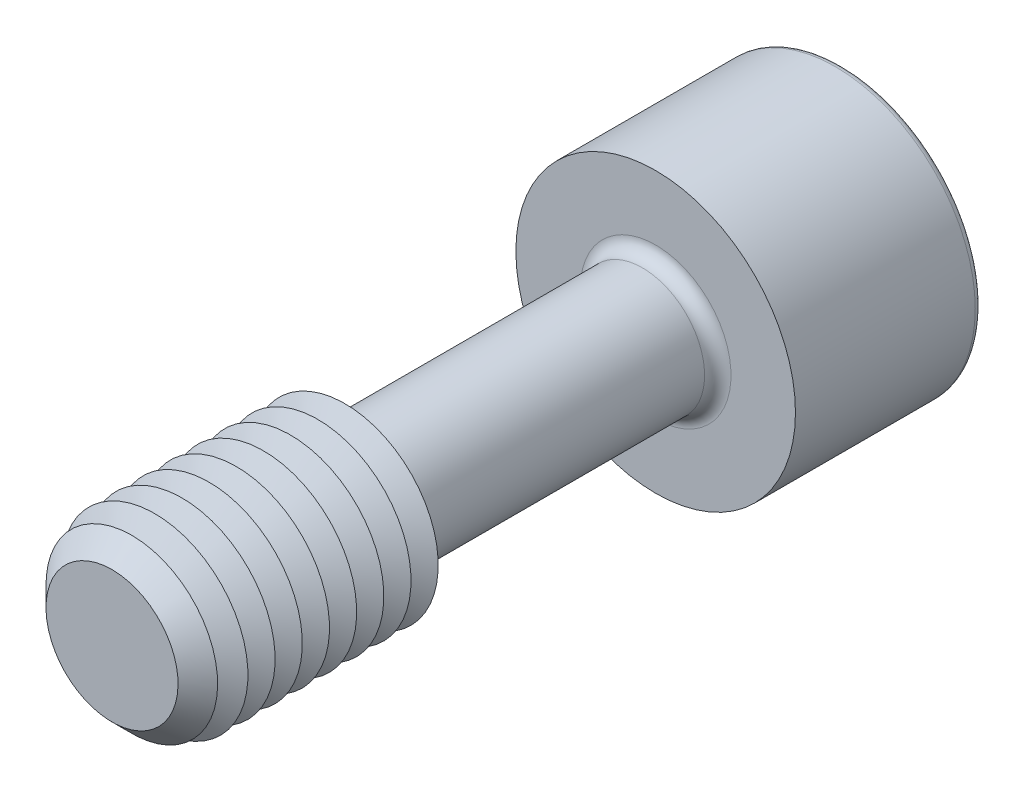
ISO-10303-21;
HEADER;
FILE_DESCRIPTION(('STEP AP214'),'2;1');
FILE_NAME('part.step','',(''),(''),'','','');
FILE_SCHEMA(('AUTOMOTIVE_DESIGN { 1 0 10303 214 1 1 1 1 }'));
ENDSEC;
DATA;
#1=APPLICATION_CONTEXT('core data for automotive mechanical design processes');
#2=APPLICATION_PROTOCOL_DEFINITION('international standard','automotive_design',2000,#1);
#3=PRODUCT_CONTEXT('',#1,'mechanical');
#4=PRODUCT('Part','Part','',(#3));
#5=PRODUCT_RELATED_PRODUCT_CATEGORY('part','',(#4));
#6=PRODUCT_DEFINITION_FORMATION('','',#4);
#7=PRODUCT_DEFINITION_CONTEXT('part definition',#1,'design');
#8=PRODUCT_DEFINITION('design','',#6,#7);
#9=PRODUCT_DEFINITION_SHAPE('','',#8);
#10=(LENGTH_UNIT() NAMED_UNIT(*) SI_UNIT(.MILLI.,.METRE.));
#11=(NAMED_UNIT(*) PLANE_ANGLE_UNIT() SI_UNIT($,.RADIAN.));
#12=(NAMED_UNIT(*) SI_UNIT($,.STERADIAN.) SOLID_ANGLE_UNIT());
#13=UNCERTAINTY_MEASURE_WITH_UNIT(LENGTH_MEASURE(1.E-05),#10,'distance_accuracy_value','');
#14=(GEOMETRIC_REPRESENTATION_CONTEXT(3) GLOBAL_UNCERTAINTY_ASSIGNED_CONTEXT((#13)) GLOBAL_UNIT_ASSIGNED_CONTEXT((#10,
#11,#12)) REPRESENTATION_CONTEXT('',''));
#15=CARTESIAN_POINT('',(0.,0.,0.));
#16=DIRECTION('',(0.,0.,1.));
#17=DIRECTION('',(1.,0.,0.));
#18=AXIS2_PLACEMENT_3D('',#15,#16,#17);
#19=CARTESIAN_POINT('',(-2.88675134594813,-5.,-19.5));
#20=DIRECTION('',(0.,0.,1.));
#21=DIRECTION('',(1.,0.,0.));
#22=AXIS2_PLACEMENT_3D('',#19,#20,#21);
#23=PLANE('',#22);
#24=DIRECTION('',(1.,0.,0.));
#25=VECTOR('',#24,1.);
#26=CARTESIAN_POINT('',(-2.88675134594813,-5.,-19.5));
#27=LINE('',#26,#25);
#28=CARTESIAN_POINT('',(0.,-5.,-19.5));
#29=VERTEX_POINT('',#28);
#30=CARTESIAN_POINT('',(2.88675134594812,-5.,-19.5));
#31=VERTEX_POINT('',#30);
#32=EDGE_CURVE('E762',#29,#31,#27,.T.);
#33=ORIENTED_EDGE('',*,*,#32,.F.);
#34=CARTESIAN_POINT('',(0.,0.,-19.5));
#35=DIRECTION('',(0.,0.,1.));
#36=DIRECTION('',(0.,-1.,0.));
#37=AXIS2_PLACEMENT_3D('',#34,#35,#36);
#38=CIRCLE('',#37,5.);
#39=CARTESIAN_POINT('',(4.3301270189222,-2.5,-19.5));
#40=VERTEX_POINT('',#39);
#41=EDGE_CURVE('E53',#29,#40,#38,.T.);
#42=ORIENTED_EDGE('',*,*,#41,.T.);
#43=DIRECTION('',(0.5,0.866025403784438,0.));
#44=VECTOR('',#43,1.);
#45=CARTESIAN_POINT('',(2.88675134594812,-5.,-19.5));
#46=LINE('',#45,#44);
#47=EDGE_CURVE('E747',#31,#40,#46,.T.);
#48=ORIENTED_EDGE('',*,*,#47,.F.);
#49=EDGE_LOOP('',(#33,#42,#48));
#50=FACE_BOUND('',#49,.T.);
#51=ADVANCED_FACE('F41',(#50),#23,.F.);
#52=CARTESIAN_POINT('',(5.77350269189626,0.,-19.5));
#53=VERTEX_POINT('',#52);
#54=EDGE_CURVE('E758',#40,#53,#46,.T.);
#55=ORIENTED_EDGE('',*,*,#54,.F.);
#56=CARTESIAN_POINT('',(4.3301270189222,2.50000000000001,-19.5));
#57=VERTEX_POINT('',#56);
#58=EDGE_CURVE('E11',#40,#57,#38,.T.);
#59=ORIENTED_EDGE('',*,*,#58,.T.);
#60=DIRECTION('',(-0.5,0.866025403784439,0.));
#61=VECTOR('',#60,1.);
#62=CARTESIAN_POINT('',(5.77350269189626,0.,-19.5));
#63=LINE('',#62,#61);
#64=EDGE_CURVE('E746',#53,#57,#63,.T.);
#65=ORIENTED_EDGE('',*,*,#64,.F.);
#66=EDGE_LOOP('',(#55,#59,#65));
#67=FACE_BOUND('',#66,.T.);
#68=ADVANCED_FACE('F133',(#67),#23,.F.);
#69=CARTESIAN_POINT('',(2.88675134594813,5.,-19.5));
#70=VERTEX_POINT('',#69);
#71=EDGE_CURVE('E741',#57,#70,#63,.T.);
#72=ORIENTED_EDGE('',*,*,#71,.F.);
#73=CARTESIAN_POINT('',(0.,5.00000000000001,-19.5));
#74=VERTEX_POINT('',#73);
#75=EDGE_CURVE('E51',#57,#74,#38,.T.);
#76=ORIENTED_EDGE('',*,*,#75,.T.);
#77=DIRECTION('',(-1.,0.,0.));
#78=VECTOR('',#77,1.);
#79=CARTESIAN_POINT('',(2.88675134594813,5.,-19.5));
#80=LINE('',#79,#78);
#81=EDGE_CURVE('E177',#70,#74,#80,.T.);
#82=ORIENTED_EDGE('',*,*,#81,.F.);
#83=EDGE_LOOP('',(#72,#76,#82));
#84=FACE_BOUND('',#83,.T.);
#85=ADVANCED_FACE('F139',(#84),#23,.F.);
#86=CARTESIAN_POINT('',(-2.88675134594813,5.,-19.5));
#87=VERTEX_POINT('',#86);
#88=EDGE_CURVE('E752',#74,#87,#80,.T.);
#89=ORIENTED_EDGE('',*,*,#88,.F.);
#90=CARTESIAN_POINT('',(-4.3301270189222,2.50000000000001,-19.5));
#91=VERTEX_POINT('',#90);
#92=EDGE_CURVE('E265',#74,#91,#38,.T.);
#93=ORIENTED_EDGE('',*,*,#92,.T.);
#94=DIRECTION('',(-0.5,-0.866025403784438,0.));
#95=VECTOR('',#94,1.);
#96=CARTESIAN_POINT('',(-2.88675134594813,5.,-19.5));
#97=LINE('',#96,#95);
#98=EDGE_CURVE('E176',#87,#91,#97,.T.);
#99=ORIENTED_EDGE('',*,*,#98,.F.);
#100=EDGE_LOOP('',(#89,#93,#99));
#101=FACE_BOUND('',#100,.T.);
#102=ADVANCED_FACE('F157',(#101),#23,.F.);
#103=CARTESIAN_POINT('',(-5.77350269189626,0.,-19.5));
#104=VERTEX_POINT('',#103);
#105=EDGE_CURVE('E170',#91,#104,#97,.T.);
#106=ORIENTED_EDGE('',*,*,#105,.F.);
#107=CARTESIAN_POINT('',(-4.3301270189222,-2.5,-19.5));
#108=VERTEX_POINT('',#107);
#109=EDGE_CURVE('E172',#91,#108,#38,.T.);
#110=ORIENTED_EDGE('',*,*,#109,.T.);
#111=DIRECTION('',(0.5,-0.866025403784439,0.));
#112=VECTOR('',#111,1.);
#113=CARTESIAN_POINT('',(-5.77350269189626,0.,-19.5));
#114=LINE('',#113,#112);
#115=EDGE_CURVE('E174',#104,#108,#114,.T.);
#116=ORIENTED_EDGE('',*,*,#115,.F.);
#117=EDGE_LOOP('',(#106,#110,#116));
#118=FACE_BOUND('',#117,.T.);
#119=ADVANCED_FACE('F146',(#118),#23,.F.);
#120=CARTESIAN_POINT('',(0.,0.,-29.5));
#121=DIRECTION('',(0.,0.,-1.));
#122=DIRECTION('',(-1.,0.,0.));
#123=AXIS2_PLACEMENT_3D('',#120,#121,#122);
#124=PLANE('',#123);
#125=CARTESIAN_POINT('',(0.,0.,-29.5));
#126=DIRECTION('',(0.,0.,-1.));
#127=DIRECTION('',(-1.,0.,0.));
#128=AXIS2_PLACEMENT_3D('',#125,#126,#127);
#129=CIRCLE('',#128,8.575);
#130=CARTESIAN_POINT('',(-8.575,0.,-29.5));
#131=VERTEX_POINT('',#130);
#132=EDGE_CURVE('E250',#131,#131,#129,.T.);
#133=ORIENTED_EDGE('',*,*,#132,.T.);
#134=EDGE_LOOP('',(#133));
#135=FACE_BOUND('',#134,.T.);
#136=DIRECTION('',(-0.5,-0.866025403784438,0.));
#137=VECTOR('',#136,1.);
#138=CARTESIAN_POINT('',(-2.88675134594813,5.,-29.5));
#139=LINE('',#138,#137);
#140=CARTESIAN_POINT('',(-2.88675134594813,5.,-29.5));
#141=VERTEX_POINT('',#140);
#142=CARTESIAN_POINT('',(-5.77350269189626,0.,-29.5));
#143=VERTEX_POINT('',#142);
#144=EDGE_CURVE('E212',#141,#143,#139,.T.);
#145=ORIENTED_EDGE('',*,*,#144,.T.);
#146=DIRECTION('',(0.5,-0.866025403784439,0.));
#147=VECTOR('',#146,1.);
#148=CARTESIAN_POINT('',(-5.77350269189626,0.,-29.5));
#149=LINE('',#148,#147);
#150=CARTESIAN_POINT('',(-2.88675134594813,-5.,-29.5));
#151=VERTEX_POINT('',#150);
#152=EDGE_CURVE('E67',#143,#151,#149,.T.);
#153=ORIENTED_EDGE('',*,*,#152,.T.);
#154=DIRECTION('',(1.,0.,0.));
#155=VECTOR('',#154,1.);
#156=CARTESIAN_POINT('',(-2.88675134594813,-5.,-29.5));
#157=LINE('',#156,#155);
#158=CARTESIAN_POINT('',(2.88675134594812,-5.,-29.5));
#159=VERTEX_POINT('',#158);
#160=EDGE_CURVE('E196',#151,#159,#157,.T.);
#161=ORIENTED_EDGE('',*,*,#160,.T.);
#162=DIRECTION('',(0.5,0.866025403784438,0.));
#163=VECTOR('',#162,1.);
#164=CARTESIAN_POINT('',(2.88675134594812,-5.,-29.5));
#165=LINE('',#164,#163);
#166=CARTESIAN_POINT('',(5.77350269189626,0.,-29.5));
#167=VERTEX_POINT('',#166);
#168=EDGE_CURVE('E200',#159,#167,#165,.T.);
#169=ORIENTED_EDGE('',*,*,#168,.T.);
#170=DIRECTION('',(-0.5,0.866025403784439,0.));
#171=VECTOR('',#170,1.);
#172=CARTESIAN_POINT('',(5.77350269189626,0.,-29.5));
#173=LINE('',#172,#171);
#174=CARTESIAN_POINT('',(2.88675134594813,5.,-29.5));
#175=VERTEX_POINT('',#174);
#176=EDGE_CURVE('E204',#167,#175,#173,.T.);
#177=ORIENTED_EDGE('',*,*,#176,.T.);
#178=DIRECTION('',(-1.,0.,0.));
#179=VECTOR('',#178,1.);
#180=CARTESIAN_POINT('',(2.88675134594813,5.,-29.5));
#181=LINE('',#180,#179);
#182=EDGE_CURVE('E208',#175,#141,#181,.T.);
#183=ORIENTED_EDGE('',*,*,#182,.T.);
#184=EDGE_LOOP('',(#145,#153,#161,#169,#177,#183));
#185=FACE_BOUND('',#184,.T.);
#186=ADVANCED_FACE('F156',(#135,#185),#124,.T.);
#187=CARTESIAN_POINT('',(0.,0.,17.5));
#188=DIRECTION('',(0.,0.,-1.));
#189=DIRECTION('',(-1.,0.,0.));
#190=AXIS2_PLACEMENT_3D('',#187,#188,#189);
#191=CYLINDRICAL_SURFACE('',#190,4.);
#192=CARTESIAN_POINT('',(0.,0.,-16.65));
#193=DIRECTION('',(0.,0.,-1.));
#194=DIRECTION('',(-1.,0.,0.));
#195=AXIS2_PLACEMENT_3D('',#192,#193,#194);
#196=CIRCLE('',#195,4.);
#197=CARTESIAN_POINT('',(-4.,0.,-16.65));
#198=VERTEX_POINT('',#197);
#199=EDGE_CURVE('E246',#198,#198,#196,.F.);
#200=ORIENTED_EDGE('',*,*,#199,.T.);
#201=EDGE_LOOP('',(#200));
#202=FACE_BOUND('',#201,.T.);
#203=CARTESIAN_POINT('',(0.,0.,1.34529946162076));
#204=DIRECTION('',(0.,0.,-1.));
#205=DIRECTION('',(0.,1.,0.));
#206=AXIS2_PLACEMENT_3D('',#203,#204,#205);
#207=CIRCLE('',#206,4.);
#208=CARTESIAN_POINT('',(0.,4.,1.34529946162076));
#209=VERTEX_POINT('',#208);
#210=EDGE_CURVE('E234',#209,#209,#207,.T.);
#211=ORIENTED_EDGE('',*,*,#210,.T.);
#212=EDGE_LOOP('',(#211));
#213=FACE_BOUND('',#212,.T.);
#214=ADVANCED_FACE('F163',(#202,#213),#191,.T.);
#215=CARTESIAN_POINT('',(0.,0.,1.34529946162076));
#216=DIRECTION('',(0.,0.,1.));
#217=DIRECTION('',(0.,-1.,0.));
#218=AXIS2_PLACEMENT_3D('',#215,#216,#217);
#219=CONICAL_SURFACE('',#218,4.,1.0471975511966);
#220=CARTESIAN_POINT('',(0.,0.,2.5));
#221=DIRECTION('',(0.,0.,-1.));
#222=DIRECTION('',(-1.,0.,0.));
#223=AXIS2_PLACEMENT_3D('',#220,#221,#222);
#224=CIRCLE('',#223,6.);
#225=CARTESIAN_POINT('',(-6.,0.,2.5));
#226=VERTEX_POINT('',#225);
#227=EDGE_CURVE('E269',#226,#226,#224,.T.);
#228=ORIENTED_EDGE('',*,*,#227,.T.);
#229=EDGE_LOOP('',(#228));
#230=FACE_BOUND('',#229,.T.);
#231=ORIENTED_EDGE('',*,*,#210,.F.);
#232=EDGE_LOOP('',(#231));
#233=FACE_BOUND('',#232,.T.);
#234=ADVANCED_FACE('F510',(#230,#233),#219,.T.);
#235=CARTESIAN_POINT('',(0.,0.,-17.5));
#236=DIRECTION('',(0.,0.,-1.));
#237=DIRECTION('',(-1.,0.,0.));
#238=AXIS2_PLACEMENT_3D('',#235,#236,#237);
#239=PLANE('',#238);
#240=CARTESIAN_POINT('',(0.,0.,-17.5));
#241=DIRECTION('',(0.,0.,-1.));
#242=DIRECTION('',(-1.,0.,0.));
#243=AXIS2_PLACEMENT_3D('',#240,#241,#242);
#244=CIRCLE('',#243,4.85);
#245=CARTESIAN_POINT('',(-4.85,0.,-17.5));
#246=VERTEX_POINT('',#245);
#247=EDGE_CURVE('E242',#246,#246,#244,.T.);
#248=ORIENTED_EDGE('',*,*,#247,.T.);
#249=EDGE_LOOP('',(#248));
#250=FACE_BOUND('',#249,.T.);
#251=CARTESIAN_POINT('',(0.,0.,-17.5));
#252=DIRECTION('',(0.,0.,-1.));
#253=DIRECTION('',(-1.,0.,0.));
#254=AXIS2_PLACEMENT_3D('',#251,#252,#253);
#255=CIRCLE('',#254,9.);
#256=CARTESIAN_POINT('',(-9.,0.,-17.5));
#257=VERTEX_POINT('',#256);
#258=EDGE_CURVE('E230',#257,#257,#255,.T.);
#259=ORIENTED_EDGE('',*,*,#258,.F.);
#260=EDGE_LOOP('',(#259));
#261=FACE_BOUND('',#260,.T.);
#262=ADVANCED_FACE('F503',(#250,#261),#239,.F.);
#263=CARTESIAN_POINT('',(0.,0.,-29.5));
#264=DIRECTION('',(0.,0.,1.));
#265=DIRECTION('',(1.,0.,0.));
#266=AXIS2_PLACEMENT_3D('',#263,#264,#265);
#267=CYLINDRICAL_SURFACE('',#266,9.);
#268=CARTESIAN_POINT('',(0.,0.,-29.075));
#269=DIRECTION('',(0.,0.,-1.));
#270=DIRECTION('',(-1.,0.,0.));
#271=AXIS2_PLACEMENT_3D('',#268,#269,#270);
#272=CIRCLE('',#271,9.);
#273=CARTESIAN_POINT('',(-9.,0.,-29.075));
#274=VERTEX_POINT('',#273);
#275=EDGE_CURVE('E253',#274,#274,#272,.F.);
#276=ORIENTED_EDGE('',*,*,#275,.T.);
#277=EDGE_LOOP('',(#276));
#278=FACE_BOUND('',#277,.T.);
#279=ORIENTED_EDGE('',*,*,#258,.T.);
#280=EDGE_LOOP('',(#279));
#281=FACE_BOUND('',#280,.T.);
#282=ADVANCED_FACE('F509',(#278,#281),#267,.T.);
#283=CARTESIAN_POINT('',(-5.77350269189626,0.,-19.5));
#284=DIRECTION('',(0.866025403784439,0.5,0.));
#285=DIRECTION('',(-0.5,0.866025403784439,0.));
#286=AXIS2_PLACEMENT_3D('',#283,#284,#285);
#287=PLANE('',#286);
#288=ORIENTED_EDGE('',*,*,#152,.F.);
#289=DIRECTION('',(0.,0.,-1.));
#290=VECTOR('',#289,1.);
#291=CARTESIAN_POINT('',(-5.77350269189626,0.,-19.5));
#292=LINE('',#291,#290);
#293=EDGE_CURVE('E186',#104,#143,#292,.T.);
#294=ORIENTED_EDGE('',*,*,#293,.F.);
#295=ORIENTED_EDGE('',*,*,#115,.T.);
#296=CARTESIAN_POINT('',(-2.88675134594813,-5.,-19.5));
#297=VERTEX_POINT('',#296);
#298=EDGE_CURVE('E215',#108,#297,#114,.T.);
#299=ORIENTED_EDGE('',*,*,#298,.T.);
#300=DIRECTION('',(0.,0.,-1.));
#301=VECTOR('',#300,1.);
#302=CARTESIAN_POINT('',(-2.88675134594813,-5.,-19.5));
#303=LINE('',#302,#301);
#304=EDGE_CURVE('E228',#297,#151,#303,.T.);
#305=ORIENTED_EDGE('',*,*,#304,.T.);
#306=EDGE_LOOP('',(#288,#294,#295,#299,#305));
#307=FACE_BOUND('',#306,.T.);
#308=ADVANCED_FACE('F521',(#307),#287,.T.);
#309=CARTESIAN_POINT('',(-2.88675134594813,-5.,-19.5));
#310=DIRECTION('',(0.,1.,0.));
#311=DIRECTION('',(0.,0.,1.));
#312=AXIS2_PLACEMENT_3D('',#309,#310,#311);
#313=PLANE('',#312);
#314=ORIENTED_EDGE('',*,*,#160,.F.);
#315=ORIENTED_EDGE('',*,*,#304,.F.);
#316=EDGE_CURVE('E759',#297,#29,#27,.T.);
#317=ORIENTED_EDGE('',*,*,#316,.T.);
#318=ORIENTED_EDGE('',*,*,#32,.T.);
#319=DIRECTION('',(0.,0.,-1.));
#320=VECTOR('',#319,1.);
#321=CARTESIAN_POINT('',(2.88675134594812,-5.,-19.5));
#322=LINE('',#321,#320);
#323=EDGE_CURVE('E225',#31,#159,#322,.T.);
#324=ORIENTED_EDGE('',*,*,#323,.T.);
#325=EDGE_LOOP('',(#314,#315,#317,#318,#324));
#326=FACE_BOUND('',#325,.T.);
#327=ADVANCED_FACE('F537',(#326),#313,.T.);
#328=CARTESIAN_POINT('',(2.88675134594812,-5.,-19.5));
#329=DIRECTION('',(-0.866025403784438,0.5,0.));
#330=DIRECTION('',(-0.5,-0.866025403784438,0.));
#331=AXIS2_PLACEMENT_3D('',#328,#329,#330);
#332=PLANE('',#331);
#333=ORIENTED_EDGE('',*,*,#168,.F.);
#334=ORIENTED_EDGE('',*,*,#323,.F.);
#335=ORIENTED_EDGE('',*,*,#47,.T.);
#336=ORIENTED_EDGE('',*,*,#54,.T.);
#337=DIRECTION('',(0.,0.,-1.));
#338=VECTOR('',#337,1.);
#339=CARTESIAN_POINT('',(5.77350269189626,0.,-19.5));
#340=LINE('',#339,#338);
#341=EDGE_CURVE('E222',#53,#167,#340,.T.);
#342=ORIENTED_EDGE('',*,*,#341,.T.);
#343=EDGE_LOOP('',(#333,#334,#335,#336,#342));
#344=FACE_BOUND('',#343,.T.);
#345=ADVANCED_FACE('F547',(#344),#332,.T.);
#346=CARTESIAN_POINT('',(5.77350269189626,0.,-19.5));
#347=DIRECTION('',(-0.866025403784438,-0.5,0.));
#348=DIRECTION('',(0.5,-0.866025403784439,0.));
#349=AXIS2_PLACEMENT_3D('',#346,#347,#348);
#350=PLANE('',#349);
#351=ORIENTED_EDGE('',*,*,#176,.F.);
#352=ORIENTED_EDGE('',*,*,#341,.F.);
#353=ORIENTED_EDGE('',*,*,#64,.T.);
#354=ORIENTED_EDGE('',*,*,#71,.T.);
#355=DIRECTION('',(0.,0.,-1.));
#356=VECTOR('',#355,1.);
#357=CARTESIAN_POINT('',(2.88675134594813,5.,-19.5));
#358=LINE('',#357,#356);
#359=EDGE_CURVE('E219',#70,#175,#358,.T.);
#360=ORIENTED_EDGE('',*,*,#359,.T.);
#361=EDGE_LOOP('',(#351,#352,#353,#354,#360));
#362=FACE_BOUND('',#361,.T.);
#363=ADVANCED_FACE('F557',(#362),#350,.T.);
#364=CARTESIAN_POINT('',(2.88675134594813,5.,-19.5));
#365=DIRECTION('',(0.,-1.,0.));
#366=DIRECTION('',(0.,0.,-1.));
#367=AXIS2_PLACEMENT_3D('',#364,#365,#366);
#368=PLANE('',#367);
#369=ORIENTED_EDGE('',*,*,#182,.F.);
#370=ORIENTED_EDGE('',*,*,#359,.F.);
#371=ORIENTED_EDGE('',*,*,#81,.T.);
#372=ORIENTED_EDGE('',*,*,#88,.T.);
#373=DIRECTION('',(0.,0.,-1.));
#374=VECTOR('',#373,1.);
#375=CARTESIAN_POINT('',(-2.88675134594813,5.,-19.5));
#376=LINE('',#375,#374);
#377=EDGE_CURVE('E182',#87,#141,#376,.T.);
#378=ORIENTED_EDGE('',*,*,#377,.T.);
#379=EDGE_LOOP('',(#369,#370,#371,#372,#378));
#380=FACE_BOUND('',#379,.T.);
#381=ADVANCED_FACE('F152',(#380),#368,.T.);
#382=CARTESIAN_POINT('',(-2.88675134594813,5.,-19.5));
#383=DIRECTION('',(0.866025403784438,-0.5,0.));
#384=DIRECTION('',(0.5,0.866025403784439,0.));
#385=AXIS2_PLACEMENT_3D('',#382,#383,#384);
#386=PLANE('',#385);
#387=ORIENTED_EDGE('',*,*,#144,.F.);
#388=ORIENTED_EDGE('',*,*,#377,.F.);
#389=ORIENTED_EDGE('',*,*,#98,.T.);
#390=ORIENTED_EDGE('',*,*,#105,.T.);
#391=ORIENTED_EDGE('',*,*,#293,.T.);
#392=EDGE_LOOP('',(#387,#388,#389,#390,#391));
#393=FACE_BOUND('',#392,.T.);
#394=ADVANCED_FACE('F144',(#393),#386,.T.);
#395=ORIENTED_EDGE('',*,*,#298,.F.);
#396=EDGE_CURVE('E256',#108,#29,#38,.T.);
#397=ORIENTED_EDGE('',*,*,#396,.T.);
#398=ORIENTED_EDGE('',*,*,#316,.F.);
#399=EDGE_LOOP('',(#395,#397,#398));
#400=FACE_BOUND('',#399,.T.);
#401=ADVANCED_FACE('F135',(#400),#23,.F.);
#402=CARTESIAN_POINT('',(0.,0.,-16.65));
#403=DIRECTION('',(0.,0.,-1.));
#404=DIRECTION('',(-1.,0.,0.));
#405=AXIS2_PLACEMENT_3D('',#402,#403,#404);
#406=TOROIDAL_SURFACE('',#405,4.85,0.85);
#407=ORIENTED_EDGE('',*,*,#199,.F.);
#408=EDGE_LOOP('',(#407));
#409=FACE_BOUND('',#408,.T.);
#410=ORIENTED_EDGE('',*,*,#247,.F.);
#411=EDGE_LOOP('',(#410));
#412=FACE_BOUND('',#411,.T.);
#413=ADVANCED_FACE('F129',(#409,#412),#406,.F.);
#414=CARTESIAN_POINT('',(0.,0.,-29.075));
#415=DIRECTION('',(0.,0.,-1.));
#416=DIRECTION('',(-1.,0.,0.));
#417=AXIS2_PLACEMENT_3D('',#414,#415,#416);
#418=TOROIDAL_SURFACE('',#417,8.575,0.425);
#419=ORIENTED_EDGE('',*,*,#275,.F.);
#420=EDGE_LOOP('',(#419));
#421=FACE_BOUND('',#420,.T.);
#422=ORIENTED_EDGE('',*,*,#132,.F.);
#423=EDGE_LOOP('',(#422));
#424=FACE_BOUND('',#423,.T.);
#425=ADVANCED_FACE('F43',(#421,#424),#418,.T.);
#426=CARTESIAN_POINT('',(0.,0.,-16.6132486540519));
#427=DIRECTION('',(0.,0.,-1.));
#428=DIRECTION('',(0.,1.,0.));
#429=AXIS2_PLACEMENT_3D('',#426,#427,#428);
#430=CONICAL_SURFACE('',#429,0.,1.04719755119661);
#431=ORIENTED_EDGE('',*,*,#41,.F.);
#432=ORIENTED_EDGE('',*,*,#396,.F.);
#433=ORIENTED_EDGE('',*,*,#109,.F.);
#434=ORIENTED_EDGE('',*,*,#92,.F.);
#435=ORIENTED_EDGE('',*,*,#75,.F.);
#436=ORIENTED_EDGE('',*,*,#58,.F.);
#437=EDGE_LOOP('',(#431,#432,#433,#434,#435,#436));
#438=FACE_BOUND('',#437,.T.);
#439=CARTESIAN_POINT('',(0.,0.,-16.6132486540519));
#440=VERTEX_POINT('',#439);
#441=VERTEX_LOOP('',#440);
#442=FACE_BOUND('',#441,.T.);
#443=ADVANCED_FACE('F118',(#438,#442),#430,.F.);
#444=CARTESIAN_POINT('',(0.,0.,3.375));
#445=DIRECTION('',(0.,0.,-1.));
#446=DIRECTION('',(-1.,0.,0.));
#447=AXIS2_PLACEMENT_3D('',#444,#445,#446);
#448=CONICAL_SURFACE('',#447,4.48445554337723,1.0471975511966);
#449=ORIENTED_EDGE('',*,*,#227,.F.);
#450=EDGE_LOOP('',(#449));
#451=FACE_BOUND('',#450,.T.);
#452=CARTESIAN_POINT('',(0.,0.,3.375));
#453=DIRECTION('',(0.,0.,-1.));
#454=DIRECTION('',(-1.,0.,0.));
#455=AXIS2_PLACEMENT_3D('',#452,#453,#454);
#456=CIRCLE('',#455,4.48445554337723);
#457=CARTESIAN_POINT('',(-4.48445554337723,0.,3.375));
#458=VERTEX_POINT('',#457);
#459=EDGE_CURVE('E273',#458,#458,#456,.T.);
#460=ORIENTED_EDGE('',*,*,#459,.T.);
#461=EDGE_LOOP('',(#460));
#462=FACE_BOUND('',#461,.T.);
#463=ADVANCED_FACE('F120',(#451,#462),#448,.T.);
#464=CARTESIAN_POINT('',(0.,0.,4.25));
#465=DIRECTION('',(0.,0.,1.));
#466=DIRECTION('',(1.,0.,0.));
#467=AXIS2_PLACEMENT_3D('',#464,#465,#466);
#468=CONICAL_SURFACE('',#467,6.,1.0471975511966);
#469=ORIENTED_EDGE('',*,*,#459,.F.);
#470=EDGE_LOOP('',(#469));
#471=FACE_BOUND('',#470,.T.);
#472=CARTESIAN_POINT('',(0.,0.,4.25));
#473=DIRECTION('',(0.,0.,-1.));
#474=DIRECTION('',(-1.,0.,0.));
#475=AXIS2_PLACEMENT_3D('',#472,#473,#474);
#476=CIRCLE('',#475,6.);
#477=CARTESIAN_POINT('',(-6.,0.,4.25));
#478=VERTEX_POINT('',#477);
#479=EDGE_CURVE('E278',#478,#478,#476,.T.);
#480=ORIENTED_EDGE('',*,*,#479,.T.);
#481=EDGE_LOOP('',(#480));
#482=FACE_BOUND('',#481,.T.);
#483=ADVANCED_FACE('F126',(#471,#482),#468,.T.);
#484=CARTESIAN_POINT('',(0.,0.,5.125));
#485=DIRECTION('',(0.,0.,-1.));
#486=DIRECTION('',(-1.,0.,0.));
#487=AXIS2_PLACEMENT_3D('',#484,#485,#486);
#488=CONICAL_SURFACE('',#487,4.48445554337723,1.0471975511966);
#489=ORIENTED_EDGE('',*,*,#479,.F.);
#490=EDGE_LOOP('',(#489));
#491=FACE_BOUND('',#490,.T.);
#492=CARTESIAN_POINT('',(0.,0.,5.125));
#493=DIRECTION('',(0.,0.,-1.));
#494=DIRECTION('',(-1.,0.,0.));
#495=AXIS2_PLACEMENT_3D('',#492,#493,#494);
#496=CIRCLE('',#495,4.48445554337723);
#497=CARTESIAN_POINT('',(-4.48445554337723,0.,5.125));
#498=VERTEX_POINT('',#497);
#499=EDGE_CURVE('E283',#498,#498,#496,.T.);
#500=ORIENTED_EDGE('',*,*,#499,.T.);
#501=EDGE_LOOP('',(#500));
#502=FACE_BOUND('',#501,.T.);
#503=ADVANCED_FACE('F397',(#491,#502),#488,.T.);
#504=CARTESIAN_POINT('',(0.,0.,6.));
#505=DIRECTION('',(0.,0.,1.));
#506=DIRECTION('',(1.,0.,0.));
#507=AXIS2_PLACEMENT_3D('',#504,#505,#506);
#508=CONICAL_SURFACE('',#507,6.,1.0471975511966);
#509=ORIENTED_EDGE('',*,*,#499,.F.);
#510=EDGE_LOOP('',(#509));
#511=FACE_BOUND('',#510,.T.);
#512=CARTESIAN_POINT('',(0.,0.,6.));
#513=DIRECTION('',(0.,0.,-1.));
#514=DIRECTION('',(-1.,0.,0.));
#515=AXIS2_PLACEMENT_3D('',#512,#513,#514);
#516=CIRCLE('',#515,6.);
#517=CARTESIAN_POINT('',(-6.,0.,6.));
#518=VERTEX_POINT('',#517);
#519=EDGE_CURVE('E287',#518,#518,#516,.T.);
#520=ORIENTED_EDGE('',*,*,#519,.T.);
#521=EDGE_LOOP('',(#520));
#522=FACE_BOUND('',#521,.T.);
#523=ADVANCED_FACE('F393',(#511,#522),#508,.T.);
#524=CARTESIAN_POINT('',(0.,0.,6.875));
#525=DIRECTION('',(0.,0.,-1.));
#526=DIRECTION('',(-1.,0.,0.));
#527=AXIS2_PLACEMENT_3D('',#524,#525,#526);
#528=CONICAL_SURFACE('',#527,4.48445554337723,1.0471975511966);
#529=ORIENTED_EDGE('',*,*,#519,.F.);
#530=EDGE_LOOP('',(#529));
#531=FACE_BOUND('',#530,.T.);
#532=CARTESIAN_POINT('',(0.,0.,6.875));
#533=DIRECTION('',(0.,0.,-1.));
#534=DIRECTION('',(-1.,0.,0.));
#535=AXIS2_PLACEMENT_3D('',#532,#533,#534);
#536=CIRCLE('',#535,4.48445554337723);
#537=CARTESIAN_POINT('',(-4.48445554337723,0.,6.875));
#538=VERTEX_POINT('',#537);
#539=EDGE_CURVE('E291',#538,#538,#536,.T.);
#540=ORIENTED_EDGE('',*,*,#539,.T.);
#541=EDGE_LOOP('',(#540));
#542=FACE_BOUND('',#541,.T.);
#543=ADVANCED_FACE('F389',(#531,#542),#528,.T.);
#544=CARTESIAN_POINT('',(0.,0.,7.75));
#545=DIRECTION('',(0.,0.,1.));
#546=DIRECTION('',(1.,0.,0.));
#547=AXIS2_PLACEMENT_3D('',#544,#545,#546);
#548=CONICAL_SURFACE('',#547,6.,1.0471975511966);
#549=ORIENTED_EDGE('',*,*,#539,.F.);
#550=EDGE_LOOP('',(#549));
#551=FACE_BOUND('',#550,.T.);
#552=CARTESIAN_POINT('',(0.,0.,7.75));
#553=DIRECTION('',(0.,0.,-1.));
#554=DIRECTION('',(-1.,0.,0.));
#555=AXIS2_PLACEMENT_3D('',#552,#553,#554);
#556=CIRCLE('',#555,6.);
#557=CARTESIAN_POINT('',(-6.,0.,7.75));
#558=VERTEX_POINT('',#557);
#559=EDGE_CURVE('E295',#558,#558,#556,.T.);
#560=ORIENTED_EDGE('',*,*,#559,.T.);
#561=EDGE_LOOP('',(#560));
#562=FACE_BOUND('',#561,.T.);
#563=ADVANCED_FACE('F385',(#551,#562),#548,.T.);
#564=CARTESIAN_POINT('',(0.,0.,8.625));
#565=DIRECTION('',(0.,0.,-1.));
#566=DIRECTION('',(-1.,0.,0.));
#567=AXIS2_PLACEMENT_3D('',#564,#565,#566);
#568=CONICAL_SURFACE('',#567,4.48445554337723,1.0471975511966);
#569=ORIENTED_EDGE('',*,*,#559,.F.);
#570=EDGE_LOOP('',(#569));
#571=FACE_BOUND('',#570,.T.);
#572=CARTESIAN_POINT('',(0.,0.,8.625));
#573=DIRECTION('',(0.,0.,-1.));
#574=DIRECTION('',(-1.,0.,0.));
#575=AXIS2_PLACEMENT_3D('',#572,#573,#574);
#576=CIRCLE('',#575,4.48445554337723);
#577=CARTESIAN_POINT('',(-4.48445554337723,0.,8.625));
#578=VERTEX_POINT('',#577);
#579=EDGE_CURVE('E299',#578,#578,#576,.T.);
#580=ORIENTED_EDGE('',*,*,#579,.T.);
#581=EDGE_LOOP('',(#580));
#582=FACE_BOUND('',#581,.T.);
#583=ADVANCED_FACE('F381',(#571,#582),#568,.T.);
#584=CARTESIAN_POINT('',(0.,0.,9.5));
#585=DIRECTION('',(0.,0.,1.));
#586=DIRECTION('',(1.,0.,0.));
#587=AXIS2_PLACEMENT_3D('',#584,#585,#586);
#588=CONICAL_SURFACE('',#587,6.,1.0471975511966);
#589=ORIENTED_EDGE('',*,*,#579,.F.);
#590=EDGE_LOOP('',(#589));
#591=FACE_BOUND('',#590,.T.);
#592=CARTESIAN_POINT('',(0.,0.,9.5));
#593=DIRECTION('',(0.,0.,-1.));
#594=DIRECTION('',(-1.,0.,0.));
#595=AXIS2_PLACEMENT_3D('',#592,#593,#594);
#596=CIRCLE('',#595,6.);
#597=CARTESIAN_POINT('',(-6.,0.,9.5));
#598=VERTEX_POINT('',#597);
#599=EDGE_CURVE('E302',#598,#598,#596,.T.);
#600=ORIENTED_EDGE('',*,*,#599,.T.);
#601=EDGE_LOOP('',(#600));
#602=FACE_BOUND('',#601,.T.);
#603=ADVANCED_FACE('F377',(#591,#602),#588,.T.);
#604=CARTESIAN_POINT('',(0.,0.,10.375));
#605=DIRECTION('',(0.,0.,-1.));
#606=DIRECTION('',(-1.,0.,0.));
#607=AXIS2_PLACEMENT_3D('',#604,#605,#606);
#608=CONICAL_SURFACE('',#607,4.48445554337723,1.0471975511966);
#609=ORIENTED_EDGE('',*,*,#599,.F.);
#610=EDGE_LOOP('',(#609));
#611=FACE_BOUND('',#610,.T.);
#612=CARTESIAN_POINT('',(0.,0.,10.375));
#613=DIRECTION('',(0.,0.,-1.));
#614=DIRECTION('',(-1.,0.,0.));
#615=AXIS2_PLACEMENT_3D('',#612,#613,#614);
#616=CIRCLE('',#615,4.48445554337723);
#617=CARTESIAN_POINT('',(-4.48445554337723,0.,10.375));
#618=VERTEX_POINT('',#617);
#619=EDGE_CURVE('E306',#618,#618,#616,.T.);
#620=ORIENTED_EDGE('',*,*,#619,.T.);
#621=EDGE_LOOP('',(#620));
#622=FACE_BOUND('',#621,.T.);
#623=ADVANCED_FACE('F373',(#611,#622),#608,.T.);
#624=CARTESIAN_POINT('',(0.,0.,11.25));
#625=DIRECTION('',(0.,0.,1.));
#626=DIRECTION('',(1.,0.,0.));
#627=AXIS2_PLACEMENT_3D('',#624,#625,#626);
#628=CONICAL_SURFACE('',#627,6.,1.0471975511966);
#629=ORIENTED_EDGE('',*,*,#619,.F.);
#630=EDGE_LOOP('',(#629));
#631=FACE_BOUND('',#630,.T.);
#632=CARTESIAN_POINT('',(0.,0.,11.25));
#633=DIRECTION('',(0.,0.,-1.));
#634=DIRECTION('',(-1.,0.,0.));
#635=AXIS2_PLACEMENT_3D('',#632,#633,#634);
#636=CIRCLE('',#635,6.);
#637=CARTESIAN_POINT('',(-6.,0.,11.25));
#638=VERTEX_POINT('',#637);
#639=EDGE_CURVE('E310',#638,#638,#636,.T.);
#640=ORIENTED_EDGE('',*,*,#639,.T.);
#641=EDGE_LOOP('',(#640));
#642=FACE_BOUND('',#641,.T.);
#643=ADVANCED_FACE('F369',(#631,#642),#628,.T.);
#644=CARTESIAN_POINT('',(0.,0.,12.125));
#645=DIRECTION('',(0.,0.,-1.));
#646=DIRECTION('',(-1.,0.,0.));
#647=AXIS2_PLACEMENT_3D('',#644,#645,#646);
#648=CONICAL_SURFACE('',#647,4.48445554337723,1.0471975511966);
#649=ORIENTED_EDGE('',*,*,#639,.F.);
#650=EDGE_LOOP('',(#649));
#651=FACE_BOUND('',#650,.T.);
#652=CARTESIAN_POINT('',(0.,0.,12.125));
#653=DIRECTION('',(0.,0.,-1.));
#654=DIRECTION('',(-1.,0.,0.));
#655=AXIS2_PLACEMENT_3D('',#652,#653,#654);
#656=CIRCLE('',#655,4.48445554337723);
#657=CARTESIAN_POINT('',(-4.48445554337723,0.,12.125));
#658=VERTEX_POINT('',#657);
#659=EDGE_CURVE('E314',#658,#658,#656,.T.);
#660=ORIENTED_EDGE('',*,*,#659,.T.);
#661=EDGE_LOOP('',(#660));
#662=FACE_BOUND('',#661,.T.);
#663=ADVANCED_FACE('F365',(#651,#662),#648,.T.);
#664=CARTESIAN_POINT('',(0.,0.,13.));
#665=DIRECTION('',(0.,0.,1.));
#666=DIRECTION('',(1.,0.,0.));
#667=AXIS2_PLACEMENT_3D('',#664,#665,#666);
#668=CONICAL_SURFACE('',#667,6.,1.0471975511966);
#669=ORIENTED_EDGE('',*,*,#659,.F.);
#670=EDGE_LOOP('',(#669));
#671=FACE_BOUND('',#670,.T.);
#672=CARTESIAN_POINT('',(0.,0.,13.));
#673=DIRECTION('',(0.,0.,-1.));
#674=DIRECTION('',(-1.,0.,0.));
#675=AXIS2_PLACEMENT_3D('',#672,#673,#674);
#676=CIRCLE('',#675,6.);
#677=CARTESIAN_POINT('',(-6.,0.,13.));
#678=VERTEX_POINT('',#677);
#679=EDGE_CURVE('E318',#678,#678,#676,.T.);
#680=ORIENTED_EDGE('',*,*,#679,.T.);
#681=EDGE_LOOP('',(#680));
#682=FACE_BOUND('',#681,.T.);
#683=ADVANCED_FACE('F361',(#671,#682),#668,.T.);
#684=CARTESIAN_POINT('',(0.,0.,13.875));
#685=DIRECTION('',(0.,0.,-1.));
#686=DIRECTION('',(-1.,0.,0.));
#687=AXIS2_PLACEMENT_3D('',#684,#685,#686);
#688=CONICAL_SURFACE('',#687,4.48445554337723,1.0471975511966);
#689=ORIENTED_EDGE('',*,*,#679,.F.);
#690=EDGE_LOOP('',(#689));
#691=FACE_BOUND('',#690,.T.);
#692=CARTESIAN_POINT('',(0.,0.,13.875));
#693=DIRECTION('',(0.,0.,-1.));
#694=DIRECTION('',(-1.,0.,0.));
#695=AXIS2_PLACEMENT_3D('',#692,#693,#694);
#696=CIRCLE('',#695,4.48445554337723);
#697=CARTESIAN_POINT('',(-4.48445554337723,0.,13.875));
#698=VERTEX_POINT('',#697);
#699=EDGE_CURVE('E322',#698,#698,#696,.T.);
#700=ORIENTED_EDGE('',*,*,#699,.T.);
#701=EDGE_LOOP('',(#700));
#702=FACE_BOUND('',#701,.T.);
#703=ADVANCED_FACE('F357',(#691,#702),#688,.T.);
#704=CARTESIAN_POINT('',(0.,0.,14.75));
#705=DIRECTION('',(0.,0.,1.));
#706=DIRECTION('',(1.,0.,0.));
#707=AXIS2_PLACEMENT_3D('',#704,#705,#706);
#708=CONICAL_SURFACE('',#707,6.,1.0471975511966);
#709=ORIENTED_EDGE('',*,*,#699,.F.);
#710=EDGE_LOOP('',(#709));
#711=FACE_BOUND('',#710,.T.);
#712=CARTESIAN_POINT('',(0.,0.,14.75));
#713=DIRECTION('',(0.,0.,-1.));
#714=DIRECTION('',(-1.,0.,0.));
#715=AXIS2_PLACEMENT_3D('',#712,#713,#714);
#716=CIRCLE('',#715,6.);
#717=CARTESIAN_POINT('',(-6.,0.,14.75));
#718=VERTEX_POINT('',#717);
#719=EDGE_CURVE('E326',#718,#718,#716,.T.);
#720=ORIENTED_EDGE('',*,*,#719,.T.);
#721=EDGE_LOOP('',(#720));
#722=FACE_BOUND('',#721,.T.);
#723=ADVANCED_FACE('F350',(#711,#722),#708,.T.);
#724=CARTESIAN_POINT('',(0.,0.,15.625));
#725=DIRECTION('',(0.,0.,-1.));
#726=DIRECTION('',(-1.,0.,0.));
#727=AXIS2_PLACEMENT_3D('',#724,#725,#726);
#728=CONICAL_SURFACE('',#727,4.48445554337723,1.0471975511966);
#729=ORIENTED_EDGE('',*,*,#719,.F.);
#730=EDGE_LOOP('',(#729));
#731=FACE_BOUND('',#730,.T.);
#732=CARTESIAN_POINT('',(0.,0.,15.625));
#733=DIRECTION('',(0.,0.,-1.));
#734=DIRECTION('',(-1.,0.,0.));
#735=AXIS2_PLACEMENT_3D('',#732,#733,#734);
#736=CIRCLE('',#735,4.48445554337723);
#737=CARTESIAN_POINT('',(-4.48445554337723,0.,15.625));
#738=VERTEX_POINT('',#737);
#739=EDGE_CURVE('E330',#738,#738,#736,.T.);
#740=ORIENTED_EDGE('',*,*,#739,.T.);
#741=EDGE_LOOP('',(#740));
#742=FACE_BOUND('',#741,.T.);
#743=ADVANCED_FACE('F336',(#731,#742),#728,.T.);
#744=CARTESIAN_POINT('',(0.,0.,16.5));
#745=DIRECTION('',(0.,0.,1.));
#746=DIRECTION('',(1.,0.,0.));
#747=AXIS2_PLACEMENT_3D('',#744,#745,#746);
#748=CONICAL_SURFACE('',#747,6.,1.0471975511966);
#749=CARTESIAN_POINT('',(0.,0.,16.2254809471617));
#750=DIRECTION('',(0.,0.,1.));
#751=DIRECTION('',(1.,0.,0.));
#752=AXIS2_PLACEMENT_3D('',#749,#750,#751);
#753=CIRCLE('',#752,5.52451905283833);
#754=CARTESIAN_POINT('',(0.,5.52451905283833,16.2254809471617));
#755=VERTEX_POINT('',#754);
#756=EDGE_CURVE('E45',#755,#755,#753,.F.);
#757=ORIENTED_EDGE('',*,*,#756,.T.);
#758=EDGE_LOOP('',(#757));
#759=FACE_BOUND('',#758,.T.);
#760=ORIENTED_EDGE('',*,*,#739,.F.);
#761=EDGE_LOOP('',(#760));
#762=FACE_BOUND('',#761,.T.);
#763=ADVANCED_FACE('F338',(#759,#762),#748,.T.);
#764=CARTESIAN_POINT('',(0.,0.,17.5));
#765=DIRECTION('',(0.,0.,1.));
#766=DIRECTION('',(1.,0.,0.));
#767=AXIS2_PLACEMENT_3D('',#764,#765,#766);
#768=PLANE('',#767);
#769=CARTESIAN_POINT('',(0.,0.,17.5));
#770=DIRECTION('',(0.,0.,1.));
#771=DIRECTION('',(1.,0.,0.));
#772=AXIS2_PLACEMENT_3D('',#769,#770,#771);
#773=CIRCLE('',#772,4.25);
#774=CARTESIAN_POINT('',(0.,4.25,17.5));
#775=VERTEX_POINT('',#774);
#776=EDGE_CURVE('E238',#775,#775,#773,.T.);
#777=ORIENTED_EDGE('',*,*,#776,.T.);
#778=EDGE_LOOP('',(#777));
#779=FACE_BOUND('',#778,.T.);
#780=ADVANCED_FACE('F340',(#779),#768,.T.);
#781=CARTESIAN_POINT('',(0.,0.,15.75));
#782=DIRECTION('',(0.,0.,-1.));
#783=DIRECTION('',(0.,1.,0.));
#784=AXIS2_PLACEMENT_3D('',#781,#782,#783);
#785=CONICAL_SURFACE('',#784,6.,0.785398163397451);
#786=CARTESIAN_POINT('',(0.,5.52451905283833,16.2254809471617));
#787=CARTESIAN_POINT('',(0.,5.5112428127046,16.2387571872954));
#788=CARTESIAN_POINT('',(0.,5.49796657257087,16.2520334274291));
#789=CARTESIAN_POINT('',(0.,5.4714140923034,16.2785859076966));
#790=CARTESIAN_POINT('',(0.,5.45813785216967,16.2918621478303));
#791=CARTESIAN_POINT('',(0.,5.4315853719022,16.3184146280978));
#792=CARTESIAN_POINT('',(0.,5.41830913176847,16.3316908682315));
#793=CARTESIAN_POINT('',(0.,5.39175665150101,16.358243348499));
#794=CARTESIAN_POINT('',(0.,5.37848041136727,16.3715195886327));
#795=CARTESIAN_POINT('',(0.,5.35192793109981,16.3980720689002));
#796=CARTESIAN_POINT('',(0.,5.33865169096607,16.4113483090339));
#797=CARTESIAN_POINT('',(0.,5.31209921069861,16.4379007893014));
#798=CARTESIAN_POINT('',(0.,5.29882297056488,16.4511770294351));
#799=CARTESIAN_POINT('',(0.,5.27227049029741,16.4777295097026));
#800=CARTESIAN_POINT('',(0.,5.25899425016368,16.4910057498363));
#801=CARTESIAN_POINT('',(0.,5.23244176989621,16.5175582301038));
#802=CARTESIAN_POINT('',(0.,5.21916552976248,16.5308344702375));
#803=CARTESIAN_POINT('',(0.,5.19261304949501,16.557386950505));
#804=CARTESIAN_POINT('',(0.,5.17933680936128,16.5706631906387));
#805=CARTESIAN_POINT('',(0.,5.15278432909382,16.5972156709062));
#806=CARTESIAN_POINT('',(0.,5.13950808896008,16.6104919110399));
#807=CARTESIAN_POINT('',(0.,5.11295560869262,16.6370443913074));
#808=CARTESIAN_POINT('',(0.,5.09967936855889,16.6503206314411));
#809=CARTESIAN_POINT('',(0.,5.07312688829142,16.6768731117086));
#810=CARTESIAN_POINT('',(0.,5.05985064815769,16.6901493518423));
#811=CARTESIAN_POINT('',(0.,5.03329816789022,16.7167018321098));
#812=CARTESIAN_POINT('',(0.,5.02002192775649,16.7299780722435));
#813=CARTESIAN_POINT('',(0.,4.99346944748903,16.756530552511));
#814=CARTESIAN_POINT('',(0.,4.98019320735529,16.7698067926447));
#815=CARTESIAN_POINT('',(0.,4.95364072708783,16.7963592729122));
#816=CARTESIAN_POINT('',(0.,4.9403644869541,16.8096355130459));
#817=CARTESIAN_POINT('',(0.,4.91381200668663,16.8361879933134));
#818=CARTESIAN_POINT('',(0.,4.9005357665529,16.8494642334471));
#819=CARTESIAN_POINT('',(0.,4.87398328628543,16.8760167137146));
#820=CARTESIAN_POINT('',(0.,4.8607070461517,16.8892929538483));
#821=CARTESIAN_POINT('',(0.,4.83415456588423,16.9158454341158));
#822=CARTESIAN_POINT('',(0.,4.8208783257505,16.9291216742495));
#823=CARTESIAN_POINT('',(0.,4.79432584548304,16.955674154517));
#824=CARTESIAN_POINT('',(0.,4.7810496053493,16.9689503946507));
#825=CARTESIAN_POINT('',(0.,4.75449712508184,16.9955028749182));
#826=CARTESIAN_POINT('',(0.,4.74122088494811,17.0087791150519));
#827=CARTESIAN_POINT('',(0.,4.71466840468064,17.0353315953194));
#828=CARTESIAN_POINT('',(0.,4.70139216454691,17.0486078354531));
#829=CARTESIAN_POINT('',(0.,4.67483968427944,17.0751603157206));
#830=CARTESIAN_POINT('',(0.,4.66156344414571,17.0884365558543));
#831=CARTESIAN_POINT('',(0.,4.63501096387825,17.1149890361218));
#832=CARTESIAN_POINT('',(0.,4.62173472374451,17.1282652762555));
#833=CARTESIAN_POINT('',(0.,4.59518224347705,17.154817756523));
#834=CARTESIAN_POINT('',(0.,4.58190600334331,17.1680939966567));
#835=CARTESIAN_POINT('',(0.,4.55535352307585,17.1946464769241));
#836=CARTESIAN_POINT('',(0.,4.54207728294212,17.2079227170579));
#837=CARTESIAN_POINT('',(0.,4.51552480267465,17.2344751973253));
#838=CARTESIAN_POINT('',(0.,4.50224856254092,17.2477514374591));
#839=CARTESIAN_POINT('',(0.,4.47569608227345,17.2743039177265));
#840=CARTESIAN_POINT('',(0.,4.46241984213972,17.2875801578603));
#841=CARTESIAN_POINT('',(0.,4.43586736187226,17.3141326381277));
#842=CARTESIAN_POINT('',(0.,4.42259112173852,17.3274088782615));
#843=CARTESIAN_POINT('',(0.,4.39603864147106,17.3539613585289));
#844=CARTESIAN_POINT('',(0.,4.38276240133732,17.3672375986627));
#845=CARTESIAN_POINT('',(0.,4.35620992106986,17.3937900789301));
#846=CARTESIAN_POINT('',(0.,4.34293368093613,17.4070663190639));
#847=CARTESIAN_POINT('',(0.,4.31638120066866,17.4336187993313));
#848=CARTESIAN_POINT('',(0.,4.30310496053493,17.4468950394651));
#849=CARTESIAN_POINT('',(0.,4.27655248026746,17.4734475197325));
#850=CARTESIAN_POINT('',(0.,4.26327624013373,17.4867237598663));
#851=CARTESIAN_POINT('',(0.,4.25,17.5));
#852=B_SPLINE_CURVE_WITH_KNOTS('',3,(#786,#787,#788,#789,#790,#791,#792,#793,#794,#795,#796,
#797,#798,#799,#800,#801,#802,#803,#804,#805,#806,#807,#808,#809,#810,#811,#812,#813,#814,#815,
#816,#817,#818,#819,#820,#821,#822,#823,#824,#825,#826,#827,#828,#829,#830,#831,#832,#833,#834,
#835,#836,#837,#838,#839,#840,#841,#842,#843,#844,#845,#846,#847,#848,#849,#850,#851),
.UNSPECIFIED.,.F.,.F.,(4,2,2,2,2,2,2,2,2,2,2,2,2,2,2,2,2,2,2,2,2,2,2,2,2,2,2,2,2,2,2,2,4),(0.,
0.0563263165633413,0.112652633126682,0.16897894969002,0.225305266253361,0.2816315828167,
0.337957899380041,0.39428421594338,0.45061053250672,0.506936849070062,0.5632631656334,
0.619589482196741,0.675915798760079,0.732242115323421,0.788568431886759,0.844894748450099,
0.901221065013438,0.95754738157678,1.01387369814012,1.07020001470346,1.1265263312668,
1.18285264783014,1.23917896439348,1.29550528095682,1.35183159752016,1.4081579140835,
1.46448423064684,1.52081054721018,1.57713686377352,1.63346318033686,1.6897894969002,
1.74611581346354,1.80244213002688),.UNSPECIFIED.);
#853=EDGE_CURVE('BSEAM347',#755,#775,#852,.T.);
#854=ORIENTED_EDGE('',*,*,#756,.F.);
#855=ORIENTED_EDGE('',*,*,#776,.F.);
#856=ORIENTED_EDGE('',*,*,#853,.T.);
#857=ORIENTED_EDGE('',*,*,#853,.F.);
#858=EDGE_LOOP('',(#854,#856,#855,#857));
#859=FACE_BOUND('',#858,.T.);
#860=ADVANCED_FACE('F347',(#859),#785,.T.);
#861=CLOSED_SHELL('',(#51,#68,#85,#102,#119,#186,#214,#234,#262,#282,#308,#327,#345,#363,#381,
#394,#401,#413,#425,#443,#463,#483,#503,#523,#543,#563,#583,#603,#623,#643,#663,#683,#703,#723,
#743,#763,#780,#860));
#862=MANIFOLD_SOLID_BREP('B2',#861);
#863=ADVANCED_BREP_SHAPE_REPRESENTATION('',(#18,#862),#14);
#864=SHAPE_DEFINITION_REPRESENTATION(#9,#863);
ENDSEC;
END-ISO-10303-21;
